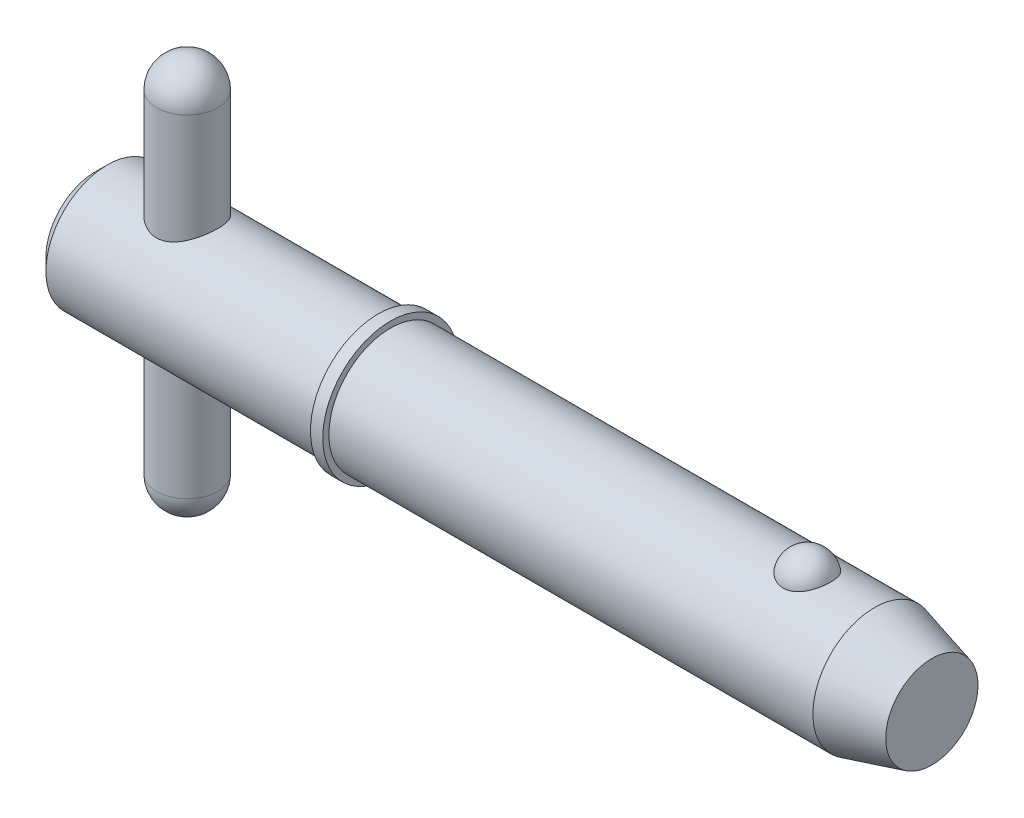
ISO-10303-21;
HEADER;
FILE_DESCRIPTION(('STEP AP214'),'2;1');
FILE_NAME('part.step','',(''),(''),'','','');
FILE_SCHEMA(('AUTOMOTIVE_DESIGN { 1 0 10303 214 1 1 1 1 }'));
ENDSEC;
DATA;
#1=APPLICATION_CONTEXT('core data for automotive mechanical design processes');
#2=APPLICATION_PROTOCOL_DEFINITION('international standard','automotive_design',2000,#1);
#3=PRODUCT_CONTEXT('',#1,'mechanical');
#4=PRODUCT('Part','Part','',(#3));
#5=PRODUCT_RELATED_PRODUCT_CATEGORY('part','',(#4));
#6=PRODUCT_DEFINITION_FORMATION('','',#4);
#7=PRODUCT_DEFINITION_CONTEXT('part definition',#1,'design');
#8=PRODUCT_DEFINITION('design','',#6,#7);
#9=PRODUCT_DEFINITION_SHAPE('','',#8);
#10=(LENGTH_UNIT() NAMED_UNIT(*) SI_UNIT(.MILLI.,.METRE.));
#11=(NAMED_UNIT(*) PLANE_ANGLE_UNIT() SI_UNIT($,.RADIAN.));
#12=(NAMED_UNIT(*) SI_UNIT($,.STERADIAN.) SOLID_ANGLE_UNIT());
#13=UNCERTAINTY_MEASURE_WITH_UNIT(LENGTH_MEASURE(1.E-05),#10,'distance_accuracy_value','');
#14=(GEOMETRIC_REPRESENTATION_CONTEXT(3) GLOBAL_UNCERTAINTY_ASSIGNED_CONTEXT((#13)) GLOBAL_UNIT_ASSIGNED_CONTEXT((#10,
#11,#12)) REPRESENTATION_CONTEXT('',''));
#15=CARTESIAN_POINT('',(0.,0.,0.));
#16=DIRECTION('',(0.,0.,1.));
#17=DIRECTION('',(1.,0.,0.));
#18=AXIS2_PLACEMENT_3D('',#15,#16,#17);
#19=CARTESIAN_POINT('',(5.94,12.7,0.));
#20=DIRECTION('',(0.,-1.,0.));
#21=DIRECTION('',(0.,0.,-1.));
#22=AXIS2_PLACEMENT_3D('',#19,#20,#21);
#23=CYLINDRICAL_SURFACE('',#22,1.98);
#24=CARTESIAN_POINT('',(5.94,-10.72,0.));
#25=DIRECTION('',(0.,-1.,0.));
#26=DIRECTION('',(0.,0.,-1.));
#27=AXIS2_PLACEMENT_3D('',#24,#25,#26);
#28=CIRCLE('',#27,1.98);
#29=CARTESIAN_POINT('',(5.94,-10.72,-1.98));
#30=VERTEX_POINT('',#29);
#31=EDGE_CURVE('P0_E10',#30,#30,#28,.F.);
#32=ORIENTED_EDGE('',*,*,#31,.T.);
#33=EDGE_LOOP('',(#32));
#34=FACE_BOUND('',#33,.T.);
#35=CARTESIAN_POINT('',(5.94,10.72,0.));
#36=DIRECTION('',(0.,-1.,0.));
#37=DIRECTION('',(0.,0.,-1.));
#38=AXIS2_PLACEMENT_3D('',#35,#36,#37);
#39=CIRCLE('',#38,1.98);
#40=CARTESIAN_POINT('',(5.94,10.72,-1.98));
#41=VERTEX_POINT('',#40);
#42=EDGE_CURVE('P0_E21',#41,#41,#39,.T.);
#43=ORIENTED_EDGE('',*,*,#42,.T.);
#44=EDGE_LOOP('',(#43));
#45=FACE_BOUND('',#44,.T.);
#46=ADVANCED_FACE('P0_F14',(#34,#45),#23,.T.);
#47=CARTESIAN_POINT('',(5.94,-10.72,0.));
#48=DIRECTION('',(0.,0.,1.));
#49=DIRECTION('',(1.,0.,0.));
#50=AXIS2_PLACEMENT_3D('',#47,#48,#49);
#51=SPHERICAL_SURFACE('',#50,1.98);
#52=CARTESIAN_POINT('',(5.94,-10.72,0.));
#53=DIRECTION('',(0.,-1.,0.));
#54=DIRECTION('',(0.,0.,-1.));
#55=AXIS2_PLACEMENT_3D('',#52,#53,#54);
#56=SPHERICAL_SURFACE('',#55,1.98);
#57=ORIENTED_EDGE('',*,*,#31,.F.);
#58=EDGE_LOOP('',(#57));
#59=FACE_BOUND('',#58,.T.);
#60=ADVANCED_FACE('P0_F29',(#59),#56,.T.);
#61=CARTESIAN_POINT('',(5.94,10.72,0.));
#62=DIRECTION('',(0.,0.,1.));
#63=DIRECTION('',(1.,0.,0.));
#64=AXIS2_PLACEMENT_3D('',#61,#62,#63);
#65=SPHERICAL_SURFACE('',#64,1.98);
#66=CARTESIAN_POINT('',(5.94,10.72,0.));
#67=DIRECTION('',(0.,-1.,0.));
#68=DIRECTION('',(0.,0.,-1.));
#69=AXIS2_PLACEMENT_3D('',#66,#67,#68);
#70=SPHERICAL_SURFACE('',#69,1.98);
#71=ORIENTED_EDGE('',*,*,#42,.F.);
#72=EDGE_LOOP('',(#71));
#73=FACE_BOUND('',#72,.T.);
#74=ADVANCED_FACE('P0_F16',(#73),#70,.T.);
#75=CLOSED_SHELL('',(#46,#60,#74));
#76=MANIFOLD_SOLID_BREP('P0_B1',#75);
#77=CARTESIAN_POINT('',(0.,0.,0.));
#78=DIRECTION('',(1.,0.,0.));
#79=DIRECTION('',(0.,0.,-1.));
#80=AXIS2_PLACEMENT_3D('',#77,#78,#79);
#81=CYLINDRICAL_SURFACE('',#80,3.97);
#82=CARTESIAN_POINT('',(50.2759395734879,0.,0.));
#83=DIRECTION('',(1.,0.,0.));
#84=DIRECTION('',(0.,0.,-1.));
#85=AXIS2_PLACEMENT_3D('',#82,#83,#84);
#86=CIRCLE('',#85,3.97);
#87=CARTESIAN_POINT('',(50.2759395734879,0.,-3.97));
#88=VERTEX_POINT('',#87);
#89=EDGE_CURVE('P1_E81',#88,#88,#86,.T.);
#90=ORIENTED_EDGE('',*,*,#89,.F.);
#91=EDGE_LOOP('',(#90));
#92=FACE_BOUND('',#91,.T.);
#93=CARTESIAN_POINT('',(19.05,0.,0.));
#94=DIRECTION('',(1.,0.,0.));
#95=DIRECTION('',(0.,0.,-1.));
#96=AXIS2_PLACEMENT_3D('',#93,#94,#95);
#97=CIRCLE('',#96,3.97);
#98=CARTESIAN_POINT('',(19.05,0.,-3.97));
#99=VERTEX_POINT('',#98);
#100=EDGE_CURVE('P1_E85',#99,#99,#97,.T.);
#101=ORIENTED_EDGE('',*,*,#100,.T.);
#102=EDGE_LOOP('',(#101));
#103=FACE_BOUND('',#102,.T.);
#104=CARTESIAN_POINT('',(45.9451922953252,3.65715365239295,1.54470941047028));
#105=CARTESIAN_POINT('',(45.8652448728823,3.65716001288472,1.54470290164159));
#106=CARTESIAN_POINT('',(45.7851650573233,3.65987074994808,1.53832549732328));
#107=CARTESIAN_POINT('',(45.6272374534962,3.6704221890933,1.51297018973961));
#108=CARTESIAN_POINT('',(45.5493961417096,3.67827646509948,1.49395894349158));
#109=CARTESIAN_POINT('',(45.3984614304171,3.69818848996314,1.44395950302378));
#110=CARTESIAN_POINT('',(45.3253560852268,3.71023513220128,1.41300293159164));
#111=CARTESIAN_POINT('',(45.1855630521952,3.7372183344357,1.34000212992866));
#112=CARTESIAN_POINT('',(45.1188725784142,3.75215363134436,1.29796274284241));
#113=CARTESIAN_POINT('',(44.9914886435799,3.78384968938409,1.20248834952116));
#114=CARTESIAN_POINT('',(44.9310299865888,3.80065129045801,1.14875388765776));
#115=CARTESIAN_POINT('',(44.8196942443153,3.83398532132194,1.03205417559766));
#116=CARTESIAN_POINT('',(44.7688200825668,3.85051766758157,0.969086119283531));
#117=CARTESIAN_POINT('',(44.6756321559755,3.88238608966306,0.832526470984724));
#118=CARTESIAN_POINT('',(44.6337961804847,3.89763698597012,0.758588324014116));
#119=CARTESIAN_POINT('',(44.5625108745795,3.92451063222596,0.604352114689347));
#120=CARTESIAN_POINT('',(44.5330623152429,3.93613315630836,0.524053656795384));
#121=CARTESIAN_POINT('',(44.4868927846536,3.95467606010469,0.358403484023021));
#122=CARTESIAN_POINT('',(44.4703127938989,3.96154426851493,0.273006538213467));
#123=CARTESIAN_POINT('',(44.450756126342,3.96967008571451,0.100408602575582));
#124=CARTESIAN_POINT('',(44.4477789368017,3.97092790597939,0.0132076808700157));
#125=CARTESIAN_POINT('',(44.4554587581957,3.96771794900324,-0.159844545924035));
#126=CARTESIAN_POINT('',(44.4660164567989,3.96329187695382,-0.245701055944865));
#127=CARTESIAN_POINT('',(44.5003800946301,3.94923163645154,-0.414277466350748));
#128=CARTESIAN_POINT('',(44.5241862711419,3.93959737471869,-0.496997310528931));
#129=CARTESIAN_POINT('',(44.5846114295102,3.91607752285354,-0.657113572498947));
#130=CARTESIAN_POINT('',(44.6212495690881,3.90218558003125,-0.734501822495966));
#131=CARTESIAN_POINT('',(44.7065935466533,3.87158287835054,-0.881704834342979));
#132=CARTESIAN_POINT('',(44.7553004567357,3.8548718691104,-0.951518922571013));
#133=CARTESIAN_POINT('',(44.8641161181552,3.82028735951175,-1.08208159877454));
#134=CARTESIAN_POINT('',(44.9242955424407,3.80240713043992,-1.14276958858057));
#135=CARTESIAN_POINT('',(45.054493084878,3.76758161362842,-1.2528243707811));
#136=CARTESIAN_POINT('',(45.1245105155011,3.75063626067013,-1.30219195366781));
#137=CARTESIAN_POINT('',(45.27118160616,3.71998948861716,-1.38729709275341));
#138=CARTESIAN_POINT('',(45.3476813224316,3.70623183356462,-1.42327904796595));
#139=CARTESIAN_POINT('',(45.5062981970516,3.68323188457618,-1.48178996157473));
#140=CARTESIAN_POINT('',(45.5884132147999,3.67398788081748,-1.5043240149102));
#141=CARTESIAN_POINT('',(45.7514810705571,3.6615216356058,-1.53440939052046));
#142=CARTESIAN_POINT('',(45.8322840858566,3.65801951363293,-1.54265826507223));
#143=CARTESIAN_POINT('',(45.9942085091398,3.65657341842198,-1.5460842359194));
#144=CARTESIAN_POINT('',(46.0753298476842,3.65862829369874,-1.54126404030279));
#145=CARTESIAN_POINT('',(46.2328122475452,3.66788969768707,-1.51908474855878));
#146=CARTESIAN_POINT('',(46.3092422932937,3.67492621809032,-1.50213925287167));
#147=CARTESIAN_POINT('',(46.4580412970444,3.69318404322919,-1.45666982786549));
#148=CARTESIAN_POINT('',(46.5304099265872,3.70440568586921,-1.42814496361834));
#149=CARTESIAN_POINT('',(46.6708029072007,3.73012749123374,-1.35956319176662));
#150=CARTESIAN_POINT('',(46.7387000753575,3.74469307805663,-1.31927107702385));
#151=CARTESIAN_POINT('',(46.8668649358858,3.77545272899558,-1.22847440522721));
#152=CARTESIAN_POINT('',(46.9271308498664,3.79164717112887,-1.17796747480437));
#153=CARTESIAN_POINT('',(47.0416346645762,3.82490325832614,-1.06519260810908));
#154=CARTESIAN_POINT('',(47.0954137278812,3.84196735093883,-1.00245914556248));
#155=CARTESIAN_POINT('',(47.1920988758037,3.87439863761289,-0.868715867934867));
#156=CARTESIAN_POINT('',(47.2350030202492,3.88976552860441,-0.797704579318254));
#157=CARTESIAN_POINT('',(47.310266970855,3.91771381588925,-0.646896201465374));
#158=CARTESIAN_POINT('',(47.3422532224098,3.93019255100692,-0.566893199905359));
#159=CARTESIAN_POINT('',(47.3931101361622,3.95043886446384,-0.402255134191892));
#160=CARTESIAN_POINT('',(47.4119807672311,3.95820643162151,-0.317620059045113));
#161=CARTESIAN_POINT('',(47.4362162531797,3.96823733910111,-0.146156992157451));
#162=CARTESIAN_POINT('',(47.4415874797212,3.970503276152,-0.0593300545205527));
#163=CARTESIAN_POINT('',(47.4387309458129,3.96930811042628,0.114057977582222));
#164=CARTESIAN_POINT('',(47.430503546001,3.9658471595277,0.200619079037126));
#165=CARTESIAN_POINT('',(47.4007063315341,3.95358562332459,0.370506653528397));
#166=CARTESIAN_POINT('',(47.3792129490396,3.94481563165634,0.453848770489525));
#167=CARTESIAN_POINT('',(47.3233839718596,3.92284586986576,0.615497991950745));
#168=CARTESIAN_POINT('',(47.2890474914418,3.90964579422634,0.69380474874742));
#169=CARTESIAN_POINT('',(47.2079702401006,3.88006987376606,0.843703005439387));
#170=CARTESIAN_POINT('',(47.1611536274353,3.86367478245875,0.915249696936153));
#171=CARTESIAN_POINT('',(47.0561897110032,3.82949741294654,1.04910810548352));
#172=CARTESIAN_POINT('',(46.9980428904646,3.81171519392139,1.11142021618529));
#173=CARTESIAN_POINT('',(46.8717433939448,3.77673366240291,1.22503948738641));
#174=CARTESIAN_POINT('',(46.8035970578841,3.75953398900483,1.27635357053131));
#175=CARTESIAN_POINT('',(46.6589009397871,3.72770506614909,1.36653336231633));
#176=CARTESIAN_POINT('',(46.582348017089,3.71307678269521,1.40539439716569));
#177=CARTESIAN_POINT('',(46.4257594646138,3.68864287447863,1.46830480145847));
#178=CARTESIAN_POINT('',(46.3459307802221,3.67869017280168,1.49281289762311));
#179=CARTESIAN_POINT('',(46.1829877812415,3.66414535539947,1.52817474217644));
#180=CARTESIAN_POINT('',(46.0998840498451,3.65953723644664,1.53906926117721));
#181=CARTESIAN_POINT('',(45.9927760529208,3.6573894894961,1.54414878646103));
#182=CARTESIAN_POINT('',(45.9689900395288,3.65715175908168,1.54471134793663));
#183=CARTESIAN_POINT('',(45.9451922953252,3.65715365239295,1.54470941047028));
#184=B_SPLINE_CURVE_WITH_KNOTS('',3,(#104,#105,#106,#107,#108,#109,#110,#111,#112,#113,#114,
#115,#116,#117,#118,#119,#120,#121,#122,#123,#124,#125,#126,#127,#128,#129,#130,#131,#132,#133,
#134,#135,#136,#137,#138,#139,#140,#141,#142,#143,#144,#145,#146,#147,#148,#149,#150,#151,#152,
#153,#154,#155,#156,#157,#158,#159,#160,#161,#162,#163,#164,#165,#166,#167,#168,#169,#170,#171,
#172,#173,#174,#175,#176,#177,#178,#179,#180,#181,#182,#183),.UNSPECIFIED.,.T.,.F.,(4,2,2,2,2,2,
2,2,2,2,2,2,2,2,2,2,2,2,2,2,2,2,2,2,2,2,2,2,2,2,2,2,2,2,2,2,2,2,2,4),(0.,0.239777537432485,
0.480190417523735,0.719971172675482,0.959647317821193,1.20639040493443,1.45320863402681,
1.71093679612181,1.96868099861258,2.22921052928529,2.48973023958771,2.74834928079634,
3.00697295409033,3.26598440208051,3.52501886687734,3.78570385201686,4.04637062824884,
4.30201257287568,4.55755760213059,4.80022994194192,5.04285200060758,5.27757006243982,
5.51230707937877,5.75210128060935,5.99195126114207,6.24392810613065,6.49594987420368,
6.75588818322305,7.01582710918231,7.27564332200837,7.53545264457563,7.79377886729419,
8.0521229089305,8.31207418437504,8.57201437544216,8.83179046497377,9.09166393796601,
9.34270057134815,9.59298357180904,9.66435753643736),.UNSPECIFIED.);
#185=CARTESIAN_POINT('',(45.9451922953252,3.65715365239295,1.54470941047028));
#186=VERTEX_POINT('',#185);
#187=EDGE_CURVE('P1_E35',#186,#186,#184,.T.);
#188=ORIENTED_EDGE('',*,*,#187,.T.);
#189=EDGE_LOOP('',(#188));
#190=FACE_BOUND('',#189,.T.);
#191=ADVANCED_FACE('P1_F13',(#92,#103,#190),#81,.T.);
#192=CARTESIAN_POINT('',(0.,0.,0.));
#193=DIRECTION('',(-1.,0.,0.));
#194=DIRECTION('',(0.,0.,1.));
#195=AXIS2_PLACEMENT_3D('',#192,#193,#194);
#196=PLANE('',#195);
#197=CARTESIAN_POINT('',(0.,0.,0.));
#198=DIRECTION('',(1.,0.,0.));
#199=DIRECTION('',(0.,0.,-1.));
#200=AXIS2_PLACEMENT_3D('',#197,#198,#199);
#201=CIRCLE('',#200,3.176);
#202=CARTESIAN_POINT('',(0.,0.,-3.176));
#203=VERTEX_POINT('',#202);
#204=EDGE_CURVE('P1_E9',#203,#203,#201,.T.);
#205=ORIENTED_EDGE('',*,*,#204,.F.);
#206=EDGE_LOOP('',(#205));
#207=FACE_BOUND('',#206,.T.);
#208=ADVANCED_FACE('P1_F15',(#207),#196,.T.);
#209=CARTESIAN_POINT('',(0.793999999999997,0.,0.));
#210=DIRECTION('',(1.,0.,0.));
#211=DIRECTION('',(0.,0.,-1.));
#212=AXIS2_PLACEMENT_3D('',#209,#210,#211);
#213=CONICAL_SURFACE('',#212,3.97,0.78539816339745);
#214=ORIENTED_EDGE('',*,*,#204,.T.);
#215=EDGE_LOOP('',(#214));
#216=FACE_BOUND('',#215,.T.);
#217=CARTESIAN_POINT('',(0.793999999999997,0.,0.));
#218=DIRECTION('',(1.,0.,0.));
#219=DIRECTION('',(0.,0.,-1.));
#220=AXIS2_PLACEMENT_3D('',#217,#218,#219);
#221=CIRCLE('',#220,3.97);
#222=CARTESIAN_POINT('',(0.793999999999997,0.,-3.97));
#223=VERTEX_POINT('',#222);
#224=EDGE_CURVE('P1_E26',#223,#223,#221,.T.);
#225=ORIENTED_EDGE('',*,*,#224,.F.);
#226=EDGE_LOOP('',(#225));
#227=FACE_BOUND('',#226,.T.);
#228=ADVANCED_FACE('P1_F77',(#216,#227),#213,.T.);
#229=CARTESIAN_POINT('',(0.,0.,0.));
#230=DIRECTION('',(1.,0.,0.));
#231=DIRECTION('',(0.,0.,-1.));
#232=AXIS2_PLACEMENT_3D('',#229,#230,#231);
#233=CYLINDRICAL_SURFACE('',#232,3.97);
#234=CARTESIAN_POINT('',(5.94,-3.44100276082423,1.98));
#235=CARTESIAN_POINT('',(5.8367885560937,-3.44101282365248,1.97999171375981));
#236=CARTESIAN_POINT('',(5.73344176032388,-3.44571749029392,1.97187534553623));
#237=CARTESIAN_POINT('',(5.52991905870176,-3.46385873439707,1.93981946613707));
#238=CARTESIAN_POINT('',(5.42975031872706,-3.47731375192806,1.91584653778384));
#239=CARTESIAN_POINT('',(5.23590869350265,-3.51100678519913,1.85336773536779));
#240=CARTESIAN_POINT('',(5.14220446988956,-3.53120882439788,1.81493880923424));
#241=CARTESIAN_POINT('',(4.9625969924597,-3.57606420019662,1.72487335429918));
#242=CARTESIAN_POINT('',(4.87669412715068,-3.6007177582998,1.67323616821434));
#243=CARTESIAN_POINT('',(4.70734412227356,-3.65417020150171,1.55325205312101));
#244=CARTESIAN_POINT('',(4.62467662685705,-3.68314323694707,1.4838818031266));
#245=CARTESIAN_POINT('',(4.47154355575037,-3.74056406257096,1.33252902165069));
#246=CARTESIAN_POINT('',(4.40108404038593,-3.76901158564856,1.25054026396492));
#247=CARTESIAN_POINT('',(4.26974803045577,-3.82445556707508,1.06956584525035));
#248=CARTESIAN_POINT('',(4.20982960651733,-3.8512271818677,0.969809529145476));
#249=CARTESIAN_POINT('',(4.10798077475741,-3.89804342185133,0.760047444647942));
#250=CARTESIAN_POINT('',(4.06603907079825,-3.91809226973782,0.650048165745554));
#251=CARTESIAN_POINT('',(4.00441878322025,-3.94794912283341,0.431181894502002));
#252=CARTESIAN_POINT('',(3.98337329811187,-3.95838209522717,0.322786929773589));
#253=CARTESIAN_POINT('',(3.9596425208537,-3.97016407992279,0.103541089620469));
#254=CARTESIAN_POINT('',(3.95694618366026,-3.97151855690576,-0.00730826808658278));
#255=CARTESIAN_POINT('',(3.9694599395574,-3.96528826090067,-0.218044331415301));
#256=CARTESIAN_POINT('',(3.98314071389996,-3.95846689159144,-0.318049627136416));
#257=CARTESIAN_POINT('',(4.02528522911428,-3.93780347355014,-0.514124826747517));
#258=CARTESIAN_POINT('',(4.05375007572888,-3.92396089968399,-0.61019443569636));
#259=CARTESIAN_POINT('',(4.12484256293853,-3.89028355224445,-0.797351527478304));
#260=CARTESIAN_POINT('',(4.16766142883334,-3.87036821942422,-0.888351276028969));
#261=CARTESIAN_POINT('',(4.26598377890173,-3.82634285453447,-1.06209448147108));
#262=CARTESIAN_POINT('',(4.32149181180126,-3.8022313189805,-1.14483496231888));
#263=CARTESIAN_POINT('',(4.44962332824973,-3.74940011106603,-1.30802500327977));
#264=CARTESIAN_POINT('',(4.52336636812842,-3.72046031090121,-1.38752498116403));
#265=CARTESIAN_POINT('',(4.68287656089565,-3.66269463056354,-1.53354043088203));
#266=CARTESIAN_POINT('',(4.7686527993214,-3.63386885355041,-1.60004599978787));
#267=CARTESIAN_POINT('',(4.9564069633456,-3.57763161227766,-1.72228426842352));
#268=CARTESIAN_POINT('',(5.05906485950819,-3.5504233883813,-1.77707534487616));
#269=CARTESIAN_POINT('',(5.27381412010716,-3.50334038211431,-1.86819784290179));
#270=CARTESIAN_POINT('',(5.38589553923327,-3.48345798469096,-1.90454844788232));
#271=CARTESIAN_POINT('',(5.6069795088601,-3.45548331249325,-1.95481643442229));
#272=CARTESIAN_POINT('',(5.71552407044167,-3.44658268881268,-1.97028113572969));
#273=CARTESIAN_POINT('',(5.93399639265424,-3.43928114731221,-1.98300600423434));
#274=CARTESIAN_POINT('',(6.04392313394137,-3.44087289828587,-1.98027888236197));
#275=CARTESIAN_POINT('',(6.24931618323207,-3.45351901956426,-1.95811780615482));
#276=CARTESIAN_POINT('',(6.34505668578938,-3.46352725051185,-1.94052989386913));
#277=CARTESIAN_POINT('',(6.53204702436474,-3.49033612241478,-1.89188242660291));
#278=CARTESIAN_POINT('',(6.62329540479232,-3.50713894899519,-1.86081853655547));
#279=CARTESIAN_POINT('',(6.80352105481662,-3.54655680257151,-1.78458666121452));
#280=CARTESIAN_POINT('',(6.89219712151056,-3.56940508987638,-1.73883178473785));
#281=CARTESIAN_POINT('',(7.06112449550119,-3.61813012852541,-1.63502913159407));
#282=CARTESIAN_POINT('',(7.14137144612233,-3.6440084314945,-1.57697504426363));
#283=CARTESIAN_POINT('',(7.30168083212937,-3.69977514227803,-1.44171920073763));
#284=CARTESIAN_POINT('',(7.38046039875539,-3.7297597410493,-1.36302972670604));
#285=CARTESIAN_POINT('',(7.52409649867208,-3.78754991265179,-1.19307190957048));
#286=CARTESIAN_POINT('',(7.58894840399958,-3.81535475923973,-1.10179940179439));
#287=CARTESIAN_POINT('',(7.70430122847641,-3.86658972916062,-0.906019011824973));
#288=CARTESIAN_POINT('',(7.75438714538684,-3.88988795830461,-0.801229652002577));
#289=CARTESIAN_POINT('',(7.83572184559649,-3.92848199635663,-0.583216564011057));
#290=CARTESIAN_POINT('',(7.86698708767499,-3.94378479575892,-0.470000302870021));
#291=CARTESIAN_POINT('',(7.90711051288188,-3.96355307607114,-0.249525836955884));
#292=CARTESIAN_POINT('',(7.91775648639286,-3.96888171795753,-0.142669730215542));
#293=CARTESIAN_POINT('',(7.92160247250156,-3.97079858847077,0.0714191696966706));
#294=CARTESIAN_POINT('',(7.91480852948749,-3.96738984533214,0.178651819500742));
#295=CARTESIAN_POINT('',(7.88515479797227,-3.9527181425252,0.383072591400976));
#296=CARTESIAN_POINT('',(7.8633739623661,-3.94198303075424,0.480459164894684));
#297=CARTESIAN_POINT('',(7.80581513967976,-3.91422178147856,0.670038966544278));
#298=CARTESIAN_POINT('',(7.77003513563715,-3.89719473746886,0.762231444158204));
#299=CARTESIAN_POINT('',(7.68389191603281,-3.85747818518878,0.943248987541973));
#300=CARTESIAN_POINT('',(7.63296879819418,-3.83457704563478,1.03175978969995));
#301=CARTESIAN_POINT('',(7.51869140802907,-3.7855122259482,1.19934744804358));
#302=CARTESIAN_POINT('',(7.45533142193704,-3.75934704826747,1.2784199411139));
#303=CARTESIAN_POINT('',(7.31068939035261,-3.70329841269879,1.433144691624));
#304=CARTESIAN_POINT('',(7.22825362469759,-3.67330340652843,1.50768183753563));
#305=CARTESIAN_POINT('',(7.05162367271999,-3.61514025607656,1.64226879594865));
#306=CARTESIAN_POINT('',(6.95741928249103,-3.58697372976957,1.70230590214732));
#307=CARTESIAN_POINT('',(6.75590859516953,-3.53504049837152,1.80775364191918));
#308=CARTESIAN_POINT('',(6.64828786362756,-3.51143624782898,1.85265616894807));
#309=CARTESIAN_POINT('',(6.48137774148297,-3.48289659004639,1.90544537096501));
#310=CARTESIAN_POINT('',(6.42488151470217,-3.4745323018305,1.9206071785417));
#311=CARTESIAN_POINT('',(6.31046920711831,-3.4604244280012,1.94591259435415));
#312=CARTESIAN_POINT('',(6.25255415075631,-3.45467900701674,1.95605971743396));
#313=CARTESIAN_POINT('',(6.1521444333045,-3.44728060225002,1.96905939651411));
#314=CARTESIAN_POINT('',(6.10985721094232,-3.44493297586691,1.97315742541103));
#315=CARTESIAN_POINT('',(6.02505433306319,-3.44179192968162,1.97862952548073));
#316=CARTESIAN_POINT('',(5.98253866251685,-3.44099861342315,1.98000341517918));
#317=CARTESIAN_POINT('',(5.94,-3.44100276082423,1.98));
#318=B_SPLINE_CURVE_WITH_KNOTS('',3,(#234,#235,#236,#237,#238,#239,#240,#241,#242,#243,#244,
#245,#246,#247,#248,#249,#250,#251,#252,#253,#254,#255,#256,#257,#258,#259,#260,#261,#262,#263,
#264,#265,#266,#267,#268,#269,#270,#271,#272,#273,#274,#275,#276,#277,#278,#279,#280,#281,#282,
#283,#284,#285,#286,#287,#288,#289,#290,#291,#292,#293,#294,#295,#296,#297,#298,#299,#300,#301,
#302,#303,#304,#305,#306,#307,#308,#309,#310,#311,#312,#313,#314,#315,#316,#317),.UNSPECIFIED.,
.T.,.F.,(4,2,2,2,2,2,2,2,2,2,2,2,2,2,2,2,2,2,2,2,2,2,2,2,2,2,2,2,2,2,2,2,2,2,2,2,2,2,2,2,2,4),
(0.,0.309462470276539,0.619579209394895,0.928068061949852,1.23657226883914,1.57038619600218,
1.90436536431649,2.26071614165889,2.61684266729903,2.94773555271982,3.27842924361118,
3.58050679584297,3.88260694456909,4.18890317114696,4.49530936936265,4.83057163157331,
5.1660884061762,5.52272472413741,5.87898927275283,6.20706708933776,6.53491569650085,
6.82716910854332,7.11951660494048,7.42541184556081,7.73146442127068,8.07586334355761,
8.42037652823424,8.77380887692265,9.12693169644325,9.44775848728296,9.76847409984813,
10.0682302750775,10.3680296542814,10.6806938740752,10.9935020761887,11.3373031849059,
11.6814044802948,12.0361164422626,12.2131519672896,12.3900632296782,12.5175998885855,
12.6451450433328),.UNSPECIFIED.);
#319=CARTESIAN_POINT('',(5.94,-3.44100276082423,1.98));
#320=VERTEX_POINT('',#319);
#321=EDGE_CURVE('P1_E17',#320,#320,#318,.T.);
#322=ORIENTED_EDGE('',*,*,#321,.F.);
#323=EDGE_LOOP('',(#322));
#324=FACE_BOUND('',#323,.T.);
#325=CARTESIAN_POINT('',(5.94,3.44100276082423,1.98));
#326=CARTESIAN_POINT('',(6.0432114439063,3.44101282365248,1.97999171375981));
#327=CARTESIAN_POINT('',(6.14655823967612,3.44571749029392,1.97187534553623));
#328=CARTESIAN_POINT('',(6.35008094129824,3.46385873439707,1.93981946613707));
#329=CARTESIAN_POINT('',(6.45024968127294,3.47731375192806,1.91584653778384));
#330=CARTESIAN_POINT('',(6.64409130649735,3.51100678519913,1.85336773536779));
#331=CARTESIAN_POINT('',(6.73779553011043,3.53120882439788,1.81493880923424));
#332=CARTESIAN_POINT('',(6.91740300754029,3.57606420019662,1.72487335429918));
#333=CARTESIAN_POINT('',(7.00330587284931,3.6007177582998,1.67323616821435));
#334=CARTESIAN_POINT('',(7.17265587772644,3.65417020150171,1.55325205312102));
#335=CARTESIAN_POINT('',(7.25532337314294,3.68314323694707,1.4838818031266));
#336=CARTESIAN_POINT('',(7.40845644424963,3.74056406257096,1.3325290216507));
#337=CARTESIAN_POINT('',(7.47891595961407,3.76901158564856,1.25054026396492));
#338=CARTESIAN_POINT('',(7.61025196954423,3.82445556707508,1.06956584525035));
#339=CARTESIAN_POINT('',(7.67017039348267,3.8512271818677,0.969809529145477));
#340=CARTESIAN_POINT('',(7.77201922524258,3.89804342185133,0.760047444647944));
#341=CARTESIAN_POINT('',(7.81396092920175,3.91809226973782,0.650048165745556));
#342=CARTESIAN_POINT('',(7.87558121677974,3.94794912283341,0.431181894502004));
#343=CARTESIAN_POINT('',(7.89662670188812,3.95838209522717,0.322786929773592));
#344=CARTESIAN_POINT('',(7.9203574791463,3.97016407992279,0.103541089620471));
#345=CARTESIAN_POINT('',(7.92305381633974,3.97151855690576,-0.00730826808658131));
#346=CARTESIAN_POINT('',(7.9105400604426,3.96528826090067,-0.2180443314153));
#347=CARTESIAN_POINT('',(7.89685928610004,3.95846689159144,-0.318049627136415));
#348=CARTESIAN_POINT('',(7.85471477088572,3.93780347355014,-0.514124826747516));
#349=CARTESIAN_POINT('',(7.82624992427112,3.92396089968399,-0.61019443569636));
#350=CARTESIAN_POINT('',(7.75515743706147,3.89028355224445,-0.797351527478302));
#351=CARTESIAN_POINT('',(7.71233857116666,3.87036821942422,-0.888351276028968));
#352=CARTESIAN_POINT('',(7.61401622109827,3.82634285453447,-1.06209448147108));
#353=CARTESIAN_POINT('',(7.55850818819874,3.8022313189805,-1.14483496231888));
#354=CARTESIAN_POINT('',(7.43037667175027,3.74940011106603,-1.30802500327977));
#355=CARTESIAN_POINT('',(7.35663363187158,3.72046031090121,-1.38752498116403));
#356=CARTESIAN_POINT('',(7.19712343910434,3.66269463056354,-1.53354043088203));
#357=CARTESIAN_POINT('',(7.1113472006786,3.63386885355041,-1.60004599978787));
#358=CARTESIAN_POINT('',(6.9235930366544,3.57763161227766,-1.72228426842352));
#359=CARTESIAN_POINT('',(6.82093514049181,3.5504233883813,-1.77707534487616));
#360=CARTESIAN_POINT('',(6.60618587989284,3.50334038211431,-1.86819784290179));
#361=CARTESIAN_POINT('',(6.49410446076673,3.48345798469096,-1.90454844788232));
#362=CARTESIAN_POINT('',(6.2730204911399,3.45548331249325,-1.95481643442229));
#363=CARTESIAN_POINT('',(6.16447592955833,3.44658268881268,-1.97028113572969));
#364=CARTESIAN_POINT('',(5.94600360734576,3.43928114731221,-1.98300600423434));
#365=CARTESIAN_POINT('',(5.83607686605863,3.44087289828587,-1.98027888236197));
#366=CARTESIAN_POINT('',(5.63068381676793,3.45351901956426,-1.95811780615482));
#367=CARTESIAN_POINT('',(5.53494331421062,3.46352725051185,-1.94052989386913));
#368=CARTESIAN_POINT('',(5.34795297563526,3.49033612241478,-1.89188242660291));
#369=CARTESIAN_POINT('',(5.25670459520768,3.50713894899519,-1.86081853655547));
#370=CARTESIAN_POINT('',(5.07647894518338,3.54655680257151,-1.78458666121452));
#371=CARTESIAN_POINT('',(4.98780287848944,3.56940508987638,-1.73883178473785));
#372=CARTESIAN_POINT('',(4.81887550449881,3.61813012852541,-1.63502913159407));
#373=CARTESIAN_POINT('',(4.73862855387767,3.6440084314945,-1.57697504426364));
#374=CARTESIAN_POINT('',(4.57831916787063,3.69977514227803,-1.44171920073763));
#375=CARTESIAN_POINT('',(4.49953960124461,3.7297597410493,-1.36302972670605));
#376=CARTESIAN_POINT('',(4.35590350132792,3.78754991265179,-1.19307190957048));
#377=CARTESIAN_POINT('',(4.29105159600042,3.81535475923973,-1.10179940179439));
#378=CARTESIAN_POINT('',(4.17569877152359,3.86658972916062,-0.906019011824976));
#379=CARTESIAN_POINT('',(4.12561285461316,3.88988795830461,-0.80122965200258));
#380=CARTESIAN_POINT('',(4.04427815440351,3.92848199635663,-0.58321656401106));
#381=CARTESIAN_POINT('',(4.01301291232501,3.94378479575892,-0.470000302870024));
#382=CARTESIAN_POINT('',(3.97288948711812,3.96355307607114,-0.249525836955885));
#383=CARTESIAN_POINT('',(3.96224351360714,3.96888171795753,-0.142669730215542));
#384=CARTESIAN_POINT('',(3.95839752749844,3.97079858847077,0.0714191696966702));
#385=CARTESIAN_POINT('',(3.96519147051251,3.96738984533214,0.178651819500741));
#386=CARTESIAN_POINT('',(3.99484520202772,3.9527181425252,0.383072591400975));
#387=CARTESIAN_POINT('',(4.01662603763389,3.94198303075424,0.480459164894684));
#388=CARTESIAN_POINT('',(4.07418486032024,3.91422178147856,0.670038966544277));
#389=CARTESIAN_POINT('',(4.10996486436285,3.89719473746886,0.762231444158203));
#390=CARTESIAN_POINT('',(4.19610808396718,3.85747818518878,0.943248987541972));
#391=CARTESIAN_POINT('',(4.24703120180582,3.83457704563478,1.03175978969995));
#392=CARTESIAN_POINT('',(4.36130859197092,3.7855122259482,1.19934744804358));
#393=CARTESIAN_POINT('',(4.42466857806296,3.75934704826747,1.2784199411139));
#394=CARTESIAN_POINT('',(4.56931060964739,3.70329841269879,1.433144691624));
#395=CARTESIAN_POINT('',(4.65174637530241,3.67330340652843,1.50768183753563));
#396=CARTESIAN_POINT('',(4.82837632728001,3.61514025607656,1.64226879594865));
#397=CARTESIAN_POINT('',(4.92258071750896,3.58697372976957,1.70230590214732));
#398=CARTESIAN_POINT('',(5.12409140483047,3.53504049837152,1.80775364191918));
#399=CARTESIAN_POINT('',(5.23171213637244,3.51143624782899,1.85265616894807));
#400=CARTESIAN_POINT('',(5.39862225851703,3.48289659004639,1.90544537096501));
#401=CARTESIAN_POINT('',(5.45511848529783,3.4745323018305,1.9206071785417));
#402=CARTESIAN_POINT('',(5.56953079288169,3.4604244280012,1.94591259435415));
#403=CARTESIAN_POINT('',(5.62744584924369,3.45467900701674,1.95605971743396));
#404=CARTESIAN_POINT('',(5.7278555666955,3.44728060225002,1.9690593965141));
#405=CARTESIAN_POINT('',(5.77014278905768,3.44493297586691,1.97315742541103));
#406=CARTESIAN_POINT('',(5.85494566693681,3.44179192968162,1.97862952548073));
#407=CARTESIAN_POINT('',(5.89746133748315,3.44099861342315,1.98000341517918));
#408=CARTESIAN_POINT('',(5.94,3.44100276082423,1.98));
#409=B_SPLINE_CURVE_WITH_KNOTS('',3,(#325,#326,#327,#328,#329,#330,#331,#332,#333,#334,#335,
#336,#337,#338,#339,#340,#341,#342,#343,#344,#345,#346,#347,#348,#349,#350,#351,#352,#353,#354,
#355,#356,#357,#358,#359,#360,#361,#362,#363,#364,#365,#366,#367,#368,#369,#370,#371,#372,#373,
#374,#375,#376,#377,#378,#379,#380,#381,#382,#383,#384,#385,#386,#387,#388,#389,#390,#391,#392,
#393,#394,#395,#396,#397,#398,#399,#400,#401,#402,#403,#404,#405,#406,#407,#408),.UNSPECIFIED.,
.T.,.F.,(4,2,2,2,2,2,2,2,2,2,2,2,2,2,2,2,2,2,2,2,2,2,2,2,2,2,2,2,2,2,2,2,2,2,2,2,2,2,2,2,2,4),
(0.,0.309462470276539,0.619579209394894,0.928068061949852,1.23657226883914,1.57038619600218,
1.90436536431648,2.26071614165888,2.61684266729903,2.94773555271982,3.27842924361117,
3.58050679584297,3.88260694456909,4.18890317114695,4.49530936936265,4.83057163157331,
5.1660884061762,5.5227247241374,5.87898927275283,6.20706708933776,6.53491569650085,
6.82716910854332,7.11951660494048,7.42541184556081,7.73146442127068,8.07586334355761,
8.42037652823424,8.77380887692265,9.12693169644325,9.44775848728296,9.76847409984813,
10.0682302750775,10.3680296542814,10.6806938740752,10.9935020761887,11.3373031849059,
11.6814044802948,12.0361164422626,12.2131519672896,12.3900632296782,12.5175998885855,
12.6451450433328),.UNSPECIFIED.);
#410=CARTESIAN_POINT('',(5.94,3.44100276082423,1.98));
#411=VERTEX_POINT('',#410);
#412=EDGE_CURVE('P1_E43',#411,#411,#409,.T.);
#413=ORIENTED_EDGE('',*,*,#412,.F.);
#414=EDGE_LOOP('',(#413));
#415=FACE_BOUND('',#414,.T.);
#416=ORIENTED_EDGE('',*,*,#224,.T.);
#417=EDGE_LOOP('',(#416));
#418=FACE_BOUND('',#417,.T.);
#419=CARTESIAN_POINT('',(18.256,0.,0.));
#420=DIRECTION('',(1.,0.,0.));
#421=DIRECTION('',(0.,0.,-1.));
#422=AXIS2_PLACEMENT_3D('',#419,#420,#421);
#423=CIRCLE('',#422,3.97);
#424=CARTESIAN_POINT('',(18.256,0.,-3.97));
#425=VERTEX_POINT('',#424);
#426=EDGE_CURVE('P1_E31',#425,#425,#423,.T.);
#427=ORIENTED_EDGE('',*,*,#426,.F.);
#428=EDGE_LOOP('',(#427));
#429=FACE_BOUND('',#428,.T.);
#430=ADVANCED_FACE('P1_F103',(#324,#415,#418,#429),#233,.T.);
#431=CARTESIAN_POINT('',(18.256,3.97,0.));
#432=DIRECTION('',(-1.,0.,0.));
#433=DIRECTION('',(0.,0.,1.));
#434=AXIS2_PLACEMENT_3D('',#431,#432,#433);
#435=PLANE('',#434);
#436=ORIENTED_EDGE('',*,*,#426,.T.);
#437=EDGE_LOOP('',(#436));
#438=FACE_BOUND('',#437,.T.);
#439=CARTESIAN_POINT('',(18.256,0.,0.));
#440=DIRECTION('',(1.,0.,0.));
#441=DIRECTION('',(0.,0.,-1.));
#442=AXIS2_PLACEMENT_3D('',#439,#440,#441);
#443=CIRCLE('',#442,4.367);
#444=CARTESIAN_POINT('',(18.256,0.,-4.367));
#445=VERTEX_POINT('',#444);
#446=EDGE_CURVE('P1_E91',#445,#445,#443,.T.);
#447=ORIENTED_EDGE('',*,*,#446,.F.);
#448=EDGE_LOOP('',(#447));
#449=FACE_BOUND('',#448,.T.);
#450=ADVANCED_FACE('P1_F100',(#438,#449),#435,.T.);
#451=CARTESIAN_POINT('',(0.,0.,0.));
#452=DIRECTION('',(1.,0.,0.));
#453=DIRECTION('',(0.,0.,-1.));
#454=AXIS2_PLACEMENT_3D('',#451,#452,#453);
#455=CYLINDRICAL_SURFACE('',#454,4.367);
#456=ORIENTED_EDGE('',*,*,#446,.T.);
#457=EDGE_LOOP('',(#456));
#458=FACE_BOUND('',#457,.T.);
#459=CARTESIAN_POINT('',(19.05,0.,0.));
#460=DIRECTION('',(1.,0.,0.));
#461=DIRECTION('',(0.,0.,-1.));
#462=AXIS2_PLACEMENT_3D('',#459,#460,#461);
#463=CIRCLE('',#462,4.367);
#464=CARTESIAN_POINT('',(19.05,0.,-4.367));
#465=VERTEX_POINT('',#464);
#466=EDGE_CURVE('P1_E88',#465,#465,#463,.T.);
#467=ORIENTED_EDGE('',*,*,#466,.F.);
#468=EDGE_LOOP('',(#467));
#469=FACE_BOUND('',#468,.T.);
#470=ADVANCED_FACE('P1_F68',(#458,#469),#455,.T.);
#471=CARTESIAN_POINT('',(19.05,4.367,0.));
#472=DIRECTION('',(1.,0.,0.));
#473=DIRECTION('',(0.,0.,-1.));
#474=AXIS2_PLACEMENT_3D('',#471,#472,#473);
#475=PLANE('',#474);
#476=ORIENTED_EDGE('',*,*,#466,.T.);
#477=EDGE_LOOP('',(#476));
#478=FACE_BOUND('',#477,.T.);
#479=ORIENTED_EDGE('',*,*,#100,.F.);
#480=EDGE_LOOP('',(#479));
#481=FACE_BOUND('',#480,.T.);
#482=ADVANCED_FACE('P1_F62',(#478,#481),#475,.T.);
#483=CARTESIAN_POINT('',(53.98,0.,0.));
#484=DIRECTION('',(-1.,0.,0.));
#485=DIRECTION('',(0.,0.,1.));
#486=AXIS2_PLACEMENT_3D('',#483,#484,#485);
#487=CONICAL_SURFACE('',#486,2.97750000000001,0.26179938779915);
#488=ORIENTED_EDGE('',*,*,#89,.T.);
#489=EDGE_LOOP('',(#488));
#490=FACE_BOUND('',#489,.T.);
#491=CARTESIAN_POINT('',(53.98,0.,0.));
#492=DIRECTION('',(1.,0.,0.));
#493=DIRECTION('',(0.,0.,-1.));
#494=AXIS2_PLACEMENT_3D('',#491,#492,#493);
#495=CIRCLE('',#494,2.97750000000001);
#496=CARTESIAN_POINT('',(53.98,0.,-2.97750000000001));
#497=VERTEX_POINT('',#496);
#498=EDGE_CURVE('P1_E42',#497,#497,#495,.T.);
#499=ORIENTED_EDGE('',*,*,#498,.F.);
#500=EDGE_LOOP('',(#499));
#501=FACE_BOUND('',#500,.T.);
#502=ADVANCED_FACE('P1_F59',(#490,#501),#487,.T.);
#503=CARTESIAN_POINT('',(53.98,2.97750000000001,0.));
#504=DIRECTION('',(1.,0.,0.));
#505=DIRECTION('',(0.,0.,-1.));
#506=AXIS2_PLACEMENT_3D('',#503,#504,#505);
#507=PLANE('',#506);
#508=ORIENTED_EDGE('',*,*,#498,.T.);
#509=EDGE_LOOP('',(#508));
#510=FACE_BOUND('',#509,.T.);
#511=ADVANCED_FACE('P1_F55',(#510),#507,.T.);
#512=CARTESIAN_POINT('',(45.9451922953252,3.573,0.));
#513=DIRECTION('',(-1.,0.,0.));
#514=DIRECTION('',(0.,-1.,0.));
#515=AXIS2_PLACEMENT_3D('',#512,#513,#514);
#516=SPHERICAL_SURFACE('',#515,1.54699999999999);
#517=ORIENTED_EDGE('',*,*,#187,.F.);
#518=EDGE_LOOP('',(#517));
#519=FACE_BOUND('',#518,.T.);
#520=ADVANCED_FACE('P1_F50',(#519),#516,.T.);
#521=CARTESIAN_POINT('',(5.94,-4.367,0.));
#522=DIRECTION('',(0.,1.,0.));
#523=DIRECTION('',(0.,0.,1.));
#524=AXIS2_PLACEMENT_3D('',#521,#522,#523);
#525=CYLINDRICAL_SURFACE('',#524,1.98);
#526=ORIENTED_EDGE('',*,*,#321,.T.);
#527=EDGE_LOOP('',(#526));
#528=FACE_BOUND('',#527,.T.);
#529=ORIENTED_EDGE('',*,*,#412,.T.);
#530=EDGE_LOOP('',(#529));
#531=FACE_BOUND('',#530,.T.);
#532=ADVANCED_FACE('P1_F54',(#528,#531),#525,.F.);
#533=CLOSED_SHELL('',(#191,#208,#228,#430,#450,#470,#482,#502,#511,#520,#532));
#534=MANIFOLD_SOLID_BREP('P1_B1',#533);
#535=ADVANCED_BREP_SHAPE_REPRESENTATION('',(#18,#76,#534),#14);
#536=SHAPE_DEFINITION_REPRESENTATION(#9,#535);
ENDSEC;
END-ISO-10303-21;
